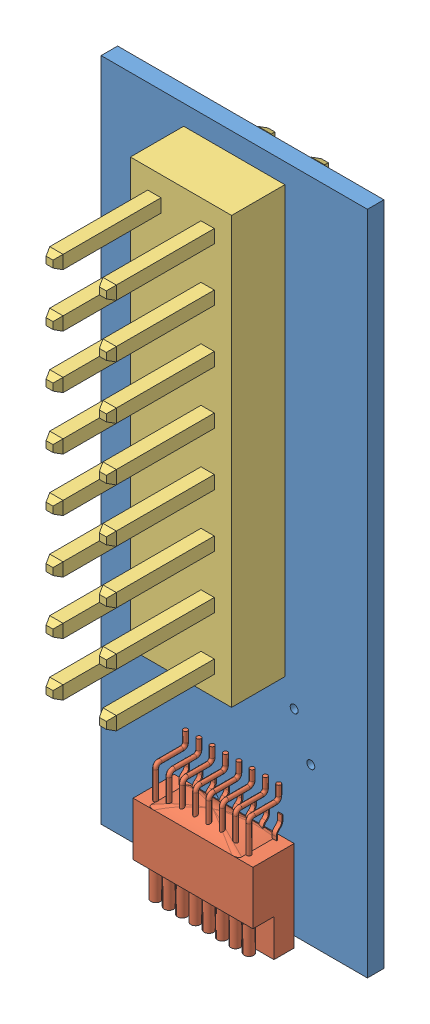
SolidWorks assembly RHS_SPI_Cable_Adapter_socket.SLDASM, configuration Default (file format 15000). Lengths in mm.
Overall size (12.7 32.26 10.59).
3 component instances, 3 part files, 4 mates.
Components (placement in the parent):
- RHS_SPI_Cable_Adapter_PCB-1: RHS_SPI_Cable_Adapter_PCB.SLDPRT [Default] at origin size (12.7 31.75 0.79)
- A79633-001-1: A79633-001.SLDPRT [Default] at (6.35 3.81 0.7874) x (1 0 0) z (0 -1 0) size (5.72 2.06 6.53)
- ConnHeader_16pos-1: ConnHeader_16pos.SLDPRT [Default] at (6.35 20.6375 0.7874) x (0 -1 0) z (-1 0 0) size (20.32 10.59 4.83)
Mates (geometry in assembly coordinates):
- Coincident1: coincident anti-aligned: plane of RHS_SPI_Cable_Adapter-1 through (0 0 0.7874) normal (0 0 1); plane of A79633-001-1 through (6.35 3.81 0.7874) normal (0 0 -1)
- Parallel1: parallel aligned: plane of RHS_SPI_Cable_Adapter-1 through (12.7 0 0.7874) normal (0 -1 0); plane of A79633-001-1 through (6.35 -0.508 0.7874) normal (0 -1 0)
- Coincident2: coincident anti-aligned: plane of RHS_SPI_Cable_Adapter-1 through (0 0 0.7874) normal (0 0 1); plane of ConnHeader_16pos-1 through (6.35 20.6375 0.7874) normal (0 0 -1)
- Parallel2: parallel aligned: plane of RHS_SPI_Cable_Adapter-1 through (12.7 0 0.7874) normal (0 -1 0); plane of ConnHeader_16pos-1 through (8.763 10.4775 3.3274) normal (0 -1 0)
